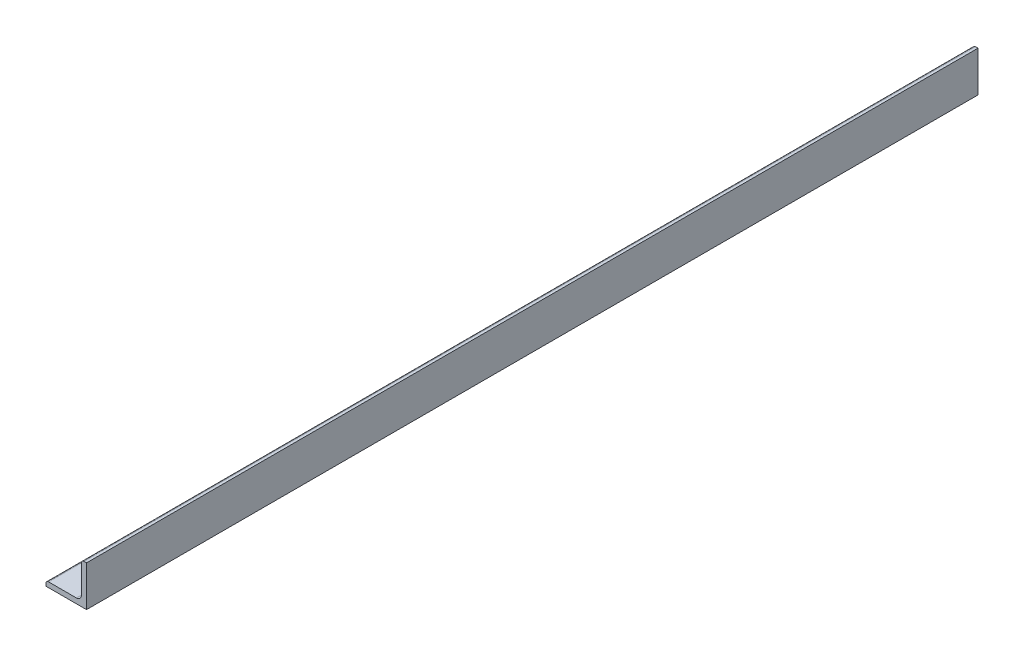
ISO-10303-21;
HEADER;
FILE_DESCRIPTION(('STEP AP214'),'2;1');
FILE_NAME('part.step','',(''),(''),'','','');
FILE_SCHEMA(('AUTOMOTIVE_DESIGN { 1 0 10303 214 1 1 1 1 }'));
ENDSEC;
DATA;
#1=APPLICATION_CONTEXT('core data for automotive mechanical design processes');
#2=APPLICATION_PROTOCOL_DEFINITION('international standard','automotive_design',2000,#1);
#3=PRODUCT_CONTEXT('',#1,'mechanical');
#4=PRODUCT('Part','Part','',(#3));
#5=PRODUCT_RELATED_PRODUCT_CATEGORY('part','',(#4));
#6=PRODUCT_DEFINITION_FORMATION('','',#4);
#7=PRODUCT_DEFINITION_CONTEXT('part definition',#1,'design');
#8=PRODUCT_DEFINITION('design','',#6,#7);
#9=PRODUCT_DEFINITION_SHAPE('','',#8);
#10=(LENGTH_UNIT() NAMED_UNIT(*) SI_UNIT(.MILLI.,.METRE.));
#11=(NAMED_UNIT(*) PLANE_ANGLE_UNIT() SI_UNIT($,.RADIAN.));
#12=(NAMED_UNIT(*) SI_UNIT($,.STERADIAN.) SOLID_ANGLE_UNIT());
#13=UNCERTAINTY_MEASURE_WITH_UNIT(LENGTH_MEASURE(1.E-05),#10,'distance_accuracy_value','');
#14=(GEOMETRIC_REPRESENTATION_CONTEXT(3) GLOBAL_UNCERTAINTY_ASSIGNED_CONTEXT((#13)) GLOBAL_UNIT_ASSIGNED_CONTEXT((#10,
#11,#12)) REPRESENTATION_CONTEXT('',''));
#15=CARTESIAN_POINT('',(0.,0.,0.));
#16=DIRECTION('',(0.,0.,1.));
#17=DIRECTION('',(1.,0.,0.));
#18=AXIS2_PLACEMENT_3D('',#15,#16,#17);
#19=CARTESIAN_POINT('',(-6.35,-5.55625000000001,139.7));
#20=DIRECTION('',(1.,0.,0.));
#21=DIRECTION('',(0.,0.,-1.));
#22=AXIS2_PLACEMENT_3D('',#19,#20,#21);
#23=PLANE('',#22);
#24=DIRECTION('',(0.,-1.,0.));
#25=VECTOR('',#24,1.);
#26=CARTESIAN_POINT('',(-6.35,-5.55625000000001,-139.7));
#27=LINE('',#26,#25);
#28=CARTESIAN_POINT('',(-6.35,-5.55625000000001,-139.7));
#29=VERTEX_POINT('',#28);
#30=CARTESIAN_POINT('',(-6.35,-6.35,-139.7));
#31=VERTEX_POINT('',#30);
#32=EDGE_CURVE('E137',#29,#31,#27,.T.);
#33=ORIENTED_EDGE('',*,*,#32,.T.);
#34=DIRECTION('',(0.,0.,-1.));
#35=VECTOR('',#34,1.);
#36=CARTESIAN_POINT('',(-6.35,-6.35,139.7));
#37=LINE('',#36,#35);
#38=CARTESIAN_POINT('',(-6.35,-6.35,139.7));
#39=VERTEX_POINT('',#38);
#40=EDGE_CURVE('E11',#39,#31,#37,.T.);
#41=ORIENTED_EDGE('',*,*,#40,.F.);
#42=DIRECTION('',(0.,-1.,0.));
#43=VECTOR('',#42,1.);
#44=CARTESIAN_POINT('',(-6.35,-5.55625000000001,139.7));
#45=LINE('',#44,#43);
#46=CARTESIAN_POINT('',(-6.35,-5.55625000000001,139.7));
#47=VERTEX_POINT('',#46);
#48=EDGE_CURVE('E153',#47,#39,#45,.T.);
#49=ORIENTED_EDGE('',*,*,#48,.F.);
#50=DIRECTION('',(0.,0.,-1.));
#51=VECTOR('',#50,1.);
#52=CARTESIAN_POINT('',(-6.35,-5.55625000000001,139.7));
#53=LINE('',#52,#51);
#54=EDGE_CURVE('E133',#47,#29,#53,.T.);
#55=ORIENTED_EDGE('',*,*,#54,.T.);
#56=EDGE_LOOP('',(#33,#41,#49,#55));
#57=FACE_BOUND('',#56,.T.);
#58=ADVANCED_FACE('F35',(#57),#23,.F.);
#59=CARTESIAN_POINT('',(-6.35,-6.35,139.7));
#60=DIRECTION('',(0.,1.,0.));
#61=DIRECTION('',(-1.,0.,0.));
#62=AXIS2_PLACEMENT_3D('',#59,#60,#61);
#63=PLANE('',#62);
#64=DIRECTION('',(1.,0.,0.));
#65=VECTOR('',#64,1.);
#66=CARTESIAN_POINT('',(-6.35,-6.35,-139.7));
#67=LINE('',#66,#65);
#68=CARTESIAN_POINT('',(6.35,-6.35,-139.7));
#69=VERTEX_POINT('',#68);
#70=EDGE_CURVE('E140',#31,#69,#67,.T.);
#71=ORIENTED_EDGE('',*,*,#70,.T.);
#72=DIRECTION('',(0.,0.,-1.));
#73=VECTOR('',#72,1.);
#74=CARTESIAN_POINT('',(6.35,-6.35,139.7));
#75=LINE('',#74,#73);
#76=CARTESIAN_POINT('',(6.35,-6.35,139.7));
#77=VERTEX_POINT('',#76);
#78=EDGE_CURVE('E43',#77,#69,#75,.T.);
#79=ORIENTED_EDGE('',*,*,#78,.F.);
#80=DIRECTION('',(1.,0.,0.));
#81=VECTOR('',#80,1.);
#82=CARTESIAN_POINT('',(-6.35,-6.35,139.7));
#83=LINE('',#82,#81);
#84=EDGE_CURVE('E97',#39,#77,#83,.T.);
#85=ORIENTED_EDGE('',*,*,#84,.F.);
#86=ORIENTED_EDGE('',*,*,#40,.T.);
#87=EDGE_LOOP('',(#71,#79,#85,#86));
#88=FACE_BOUND('',#87,.T.);
#89=ADVANCED_FACE('F196',(#88),#63,.F.);
#90=CARTESIAN_POINT('',(6.35,-6.35,139.7));
#91=DIRECTION('',(-1.,0.,0.));
#92=DIRECTION('',(0.,-1.,0.));
#93=AXIS2_PLACEMENT_3D('',#90,#91,#92);
#94=PLANE('',#93);
#95=DIRECTION('',(0.,1.,0.));
#96=VECTOR('',#95,1.);
#97=CARTESIAN_POINT('',(6.35,-6.35,-139.7));
#98=LINE('',#97,#96);
#99=CARTESIAN_POINT('',(6.35,6.35,-139.7));
#100=VERTEX_POINT('',#99);
#101=EDGE_CURVE('E142',#69,#100,#98,.T.);
#102=ORIENTED_EDGE('',*,*,#101,.T.);
#103=DIRECTION('',(0.,0.,-1.));
#104=VECTOR('',#103,1.);
#105=CARTESIAN_POINT('',(6.35,6.35,139.7));
#106=LINE('',#105,#104);
#107=CARTESIAN_POINT('',(6.35,6.35,139.7));
#108=VERTEX_POINT('',#107);
#109=EDGE_CURVE('E163',#108,#100,#106,.T.);
#110=ORIENTED_EDGE('',*,*,#109,.F.);
#111=DIRECTION('',(0.,1.,0.));
#112=VECTOR('',#111,1.);
#113=CARTESIAN_POINT('',(6.35,-6.35,139.7));
#114=LINE('',#113,#112);
#115=EDGE_CURVE('E171',#77,#108,#114,.T.);
#116=ORIENTED_EDGE('',*,*,#115,.F.);
#117=ORIENTED_EDGE('',*,*,#78,.T.);
#118=EDGE_LOOP('',(#102,#110,#116,#117));
#119=FACE_BOUND('',#118,.T.);
#120=ADVANCED_FACE('F169',(#119),#94,.F.);
#121=CARTESIAN_POINT('',(5.55625000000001,6.35,139.7));
#122=DIRECTION('',(0.,-1.,0.));
#123=DIRECTION('',(1.,0.,0.));
#124=AXIS2_PLACEMENT_3D('',#121,#122,#123);
#125=PLANE('',#124);
#126=DIRECTION('',(-1.,0.,0.));
#127=VECTOR('',#126,1.);
#128=CARTESIAN_POINT('',(5.55625000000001,6.35,-139.7));
#129=LINE('',#128,#127);
#130=CARTESIAN_POINT('',(5.55625000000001,6.35,-139.7));
#131=VERTEX_POINT('',#130);
#132=EDGE_CURVE('E144',#100,#131,#129,.T.);
#133=ORIENTED_EDGE('',*,*,#132,.T.);
#134=DIRECTION('',(0.,0.,-1.));
#135=VECTOR('',#134,1.);
#136=CARTESIAN_POINT('',(5.55625000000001,6.35,139.7));
#137=LINE('',#136,#135);
#138=CARTESIAN_POINT('',(5.55625000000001,6.35,139.7));
#139=VERTEX_POINT('',#138);
#140=EDGE_CURVE('E160',#139,#131,#137,.T.);
#141=ORIENTED_EDGE('',*,*,#140,.F.);
#142=DIRECTION('',(-1.,0.,0.));
#143=VECTOR('',#142,1.);
#144=CARTESIAN_POINT('',(5.55625000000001,6.35,139.7));
#145=LINE('',#144,#143);
#146=EDGE_CURVE('E187',#108,#139,#145,.T.);
#147=ORIENTED_EDGE('',*,*,#146,.F.);
#148=ORIENTED_EDGE('',*,*,#109,.T.);
#149=EDGE_LOOP('',(#133,#141,#147,#148));
#150=FACE_BOUND('',#149,.T.);
#151=ADVANCED_FACE('F180',(#150),#125,.F.);
#152=CARTESIAN_POINT('',(5.55625000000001,5.55625000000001,139.7));
#153=DIRECTION('',(0.,0.,-1.));
#154=DIRECTION('',(-1.,0.,0.));
#155=AXIS2_PLACEMENT_3D('',#152,#153,#154);
#156=CYLINDRICAL_SURFACE('',#155,0.793749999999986);
#157=CARTESIAN_POINT('',(5.55625000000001,5.55625000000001,-139.7));
#158=DIRECTION('',(0.,0.,1.));
#159=DIRECTION('',(-1.,0.,0.));
#160=AXIS2_PLACEMENT_3D('',#157,#158,#159);
#161=CIRCLE('',#160,0.793749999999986);
#162=CARTESIAN_POINT('',(4.76250000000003,5.55625000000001,-139.7));
#163=VERTEX_POINT('',#162);
#164=EDGE_CURVE('E146',#131,#163,#161,.T.);
#165=ORIENTED_EDGE('',*,*,#164,.T.);
#166=DIRECTION('',(0.,0.,-1.));
#167=VECTOR('',#166,1.);
#168=CARTESIAN_POINT('',(4.76250000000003,5.55625000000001,139.7));
#169=LINE('',#168,#167);
#170=CARTESIAN_POINT('',(4.76250000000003,5.55625000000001,139.7));
#171=VERTEX_POINT('',#170);
#172=EDGE_CURVE('E157',#171,#163,#169,.T.);
#173=ORIENTED_EDGE('',*,*,#172,.F.);
#174=CARTESIAN_POINT('',(5.55625000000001,5.55625000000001,139.7));
#175=DIRECTION('',(0.,0.,1.));
#176=DIRECTION('',(-1.,0.,0.));
#177=AXIS2_PLACEMENT_3D('',#174,#175,#176);
#178=CIRCLE('',#177,0.793749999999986);
#179=EDGE_CURVE('E186',#139,#171,#178,.T.);
#180=ORIENTED_EDGE('',*,*,#179,.F.);
#181=ORIENTED_EDGE('',*,*,#140,.T.);
#182=EDGE_LOOP('',(#165,#173,#180,#181));
#183=FACE_BOUND('',#182,.T.);
#184=ADVANCED_FACE('F184',(#183),#156,.T.);
#185=CARTESIAN_POINT('',(4.76250000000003,5.55625000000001,139.7));
#186=DIRECTION('',(1.,0.,0.));
#187=DIRECTION('',(0.,1.,0.));
#188=AXIS2_PLACEMENT_3D('',#185,#186,#187);
#189=PLANE('',#188);
#190=DIRECTION('',(0.,-1.,0.));
#191=VECTOR('',#190,1.);
#192=CARTESIAN_POINT('',(4.76250000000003,5.55625000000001,-139.7));
#193=LINE('',#192,#191);
#194=CARTESIAN_POINT('',(4.76250000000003,-3.18770000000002,-139.7));
#195=VERTEX_POINT('',#194);
#196=EDGE_CURVE('E148',#163,#195,#193,.T.);
#197=ORIENTED_EDGE('',*,*,#196,.T.);
#198=DIRECTION('',(0.,0.,-1.));
#199=VECTOR('',#198,1.);
#200=CARTESIAN_POINT('',(4.76250000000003,-3.18770000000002,139.7));
#201=LINE('',#200,#199);
#202=CARTESIAN_POINT('',(4.76250000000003,-3.18770000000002,139.7));
#203=VERTEX_POINT('',#202);
#204=EDGE_CURVE('E128',#203,#195,#201,.T.);
#205=ORIENTED_EDGE('',*,*,#204,.F.);
#206=DIRECTION('',(0.,-1.,0.));
#207=VECTOR('',#206,1.);
#208=CARTESIAN_POINT('',(4.76250000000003,5.55625000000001,139.7));
#209=LINE('',#208,#207);
#210=EDGE_CURVE('E119',#171,#203,#209,.T.);
#211=ORIENTED_EDGE('',*,*,#210,.F.);
#212=ORIENTED_EDGE('',*,*,#172,.T.);
#213=EDGE_LOOP('',(#197,#205,#211,#212));
#214=FACE_BOUND('',#213,.T.);
#215=ADVANCED_FACE('F208',(#214),#189,.F.);
#216=CARTESIAN_POINT('',(3.18770000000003,-3.18770000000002,139.7));
#217=DIRECTION('',(0.,0.,-1.));
#218=DIRECTION('',(-1.,0.,0.));
#219=AXIS2_PLACEMENT_3D('',#216,#217,#218);
#220=CYLINDRICAL_SURFACE('',#219,1.5748);
#221=CARTESIAN_POINT('',(3.18770000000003,-3.18770000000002,-139.7));
#222=DIRECTION('',(0.,0.,-1.));
#223=DIRECTION('',(-1.,0.,0.));
#224=AXIS2_PLACEMENT_3D('',#221,#222,#223);
#225=CIRCLE('',#224,1.5748);
#226=CARTESIAN_POINT('',(3.18770000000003,-4.76250000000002,-139.7));
#227=VERTEX_POINT('',#226);
#228=EDGE_CURVE('E127',#195,#227,#225,.T.);
#229=ORIENTED_EDGE('',*,*,#228,.T.);
#230=DIRECTION('',(0.,0.,-1.));
#231=VECTOR('',#230,1.);
#232=CARTESIAN_POINT('',(3.18770000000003,-4.76250000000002,139.7));
#233=LINE('',#232,#231);
#234=CARTESIAN_POINT('',(3.18770000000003,-4.76250000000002,139.7));
#235=VERTEX_POINT('',#234);
#236=EDGE_CURVE('E124',#235,#227,#233,.T.);
#237=ORIENTED_EDGE('',*,*,#236,.F.);
#238=CARTESIAN_POINT('',(3.18770000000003,-3.18770000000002,139.7));
#239=DIRECTION('',(0.,0.,-1.));
#240=DIRECTION('',(-1.,0.,0.));
#241=AXIS2_PLACEMENT_3D('',#238,#239,#240);
#242=CIRCLE('',#241,1.5748);
#243=EDGE_CURVE('E113',#203,#235,#242,.T.);
#244=ORIENTED_EDGE('',*,*,#243,.F.);
#245=ORIENTED_EDGE('',*,*,#204,.T.);
#246=EDGE_LOOP('',(#229,#237,#244,#245));
#247=FACE_BOUND('',#246,.T.);
#248=ADVANCED_FACE('F125',(#247),#220,.F.);
#249=CARTESIAN_POINT('',(3.18770000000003,-4.76250000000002,139.7));
#250=DIRECTION('',(0.,-1.,0.));
#251=DIRECTION('',(1.,0.,0.));
#252=AXIS2_PLACEMENT_3D('',#249,#250,#251);
#253=PLANE('',#252);
#254=DIRECTION('',(-1.,0.,0.));
#255=VECTOR('',#254,1.);
#256=CARTESIAN_POINT('',(3.18770000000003,-4.76250000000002,-139.7));
#257=LINE('',#256,#255);
#258=CARTESIAN_POINT('',(-5.55625000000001,-4.76250000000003,-139.7));
#259=VERTEX_POINT('',#258);
#260=EDGE_CURVE('E83',#227,#259,#257,.T.);
#261=ORIENTED_EDGE('',*,*,#260,.T.);
#262=DIRECTION('',(0.,0.,-1.));
#263=VECTOR('',#262,1.);
#264=CARTESIAN_POINT('',(-5.55625000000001,-4.76250000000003,139.7));
#265=LINE('',#264,#263);
#266=CARTESIAN_POINT('',(-5.55625000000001,-4.76250000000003,139.7));
#267=VERTEX_POINT('',#266);
#268=EDGE_CURVE('E129',#267,#259,#265,.T.);
#269=ORIENTED_EDGE('',*,*,#268,.F.);
#270=DIRECTION('',(-1.,0.,0.));
#271=VECTOR('',#270,1.);
#272=CARTESIAN_POINT('',(3.18770000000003,-4.76250000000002,139.7));
#273=LINE('',#272,#271);
#274=EDGE_CURVE('E117',#235,#267,#273,.T.);
#275=ORIENTED_EDGE('',*,*,#274,.F.);
#276=ORIENTED_EDGE('',*,*,#236,.T.);
#277=EDGE_LOOP('',(#261,#269,#275,#276));
#278=FACE_BOUND('',#277,.T.);
#279=ADVANCED_FACE('F131',(#278),#253,.F.);
#280=CARTESIAN_POINT('',(-5.55625000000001,-5.55625000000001,139.7));
#281=DIRECTION('',(0.,0.,-1.));
#282=DIRECTION('',(-1.,0.,0.));
#283=AXIS2_PLACEMENT_3D('',#280,#281,#282);
#284=CYLINDRICAL_SURFACE('',#283,0.793749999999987);
#285=CARTESIAN_POINT('',(-5.55625000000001,-5.55625000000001,-139.7));
#286=DIRECTION('',(0.,0.,1.));
#287=DIRECTION('',(-1.,0.,0.));
#288=AXIS2_PLACEMENT_3D('',#285,#286,#287);
#289=CIRCLE('',#288,0.793749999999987);
#290=EDGE_CURVE('E89',#259,#29,#289,.T.);
#291=ORIENTED_EDGE('',*,*,#290,.T.);
#292=ORIENTED_EDGE('',*,*,#54,.F.);
#293=CARTESIAN_POINT('',(-5.55625000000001,-5.55625000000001,139.7));
#294=DIRECTION('',(0.,0.,1.));
#295=DIRECTION('',(-1.,0.,0.));
#296=AXIS2_PLACEMENT_3D('',#293,#294,#295);
#297=CIRCLE('',#296,0.793749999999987);
#298=EDGE_CURVE('E51',#267,#47,#297,.T.);
#299=ORIENTED_EDGE('',*,*,#298,.F.);
#300=ORIENTED_EDGE('',*,*,#268,.T.);
#301=EDGE_LOOP('',(#291,#292,#299,#300));
#302=FACE_BOUND('',#301,.T.);
#303=ADVANCED_FACE('F216',(#302),#284,.T.);
#304=CARTESIAN_POINT('',(5.55625000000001,5.55625000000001,139.7));
#305=DIRECTION('',(0.,0.,-1.));
#306=DIRECTION('',(-1.,0.,0.));
#307=AXIS2_PLACEMENT_3D('',#304,#305,#306);
#308=PLANE('',#307);
#309=ORIENTED_EDGE('',*,*,#48,.T.);
#310=ORIENTED_EDGE('',*,*,#84,.T.);
#311=ORIENTED_EDGE('',*,*,#115,.T.);
#312=ORIENTED_EDGE('',*,*,#146,.T.);
#313=ORIENTED_EDGE('',*,*,#179,.T.);
#314=ORIENTED_EDGE('',*,*,#210,.T.);
#315=ORIENTED_EDGE('',*,*,#243,.T.);
#316=ORIENTED_EDGE('',*,*,#274,.T.);
#317=ORIENTED_EDGE('',*,*,#298,.T.);
#318=EDGE_LOOP('',(#309,#310,#311,#312,#313,#314,#315,#316,#317));
#319=FACE_BOUND('',#318,.T.);
#320=ADVANCED_FACE('F115',(#319),#308,.F.);
#321=CARTESIAN_POINT('',(5.55625000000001,5.55625000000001,-139.7));
#322=DIRECTION('',(0.,0.,-1.));
#323=DIRECTION('',(-1.,0.,0.));
#324=AXIS2_PLACEMENT_3D('',#321,#322,#323);
#325=PLANE('',#324);
#326=ORIENTED_EDGE('',*,*,#32,.F.);
#327=ORIENTED_EDGE('',*,*,#290,.F.);
#328=ORIENTED_EDGE('',*,*,#260,.F.);
#329=ORIENTED_EDGE('',*,*,#228,.F.);
#330=ORIENTED_EDGE('',*,*,#196,.F.);
#331=ORIENTED_EDGE('',*,*,#164,.F.);
#332=ORIENTED_EDGE('',*,*,#132,.F.);
#333=ORIENTED_EDGE('',*,*,#101,.F.);
#334=ORIENTED_EDGE('',*,*,#70,.F.);
#335=EDGE_LOOP('',(#326,#327,#328,#329,#330,#331,#332,#333,#334));
#336=FACE_BOUND('',#335,.T.);
#337=ADVANCED_FACE('F175',(#336),#325,.T.);
#338=CLOSED_SHELL('',(#58,#89,#120,#151,#184,#215,#248,#279,#303,#320,#337));
#339=MANIFOLD_SOLID_BREP('B2',#338);
#340=ADVANCED_BREP_SHAPE_REPRESENTATION('',(#18,#339),#14);
#341=SHAPE_DEFINITION_REPRESENTATION(#9,#340);
ENDSEC;
END-ISO-10303-21;
